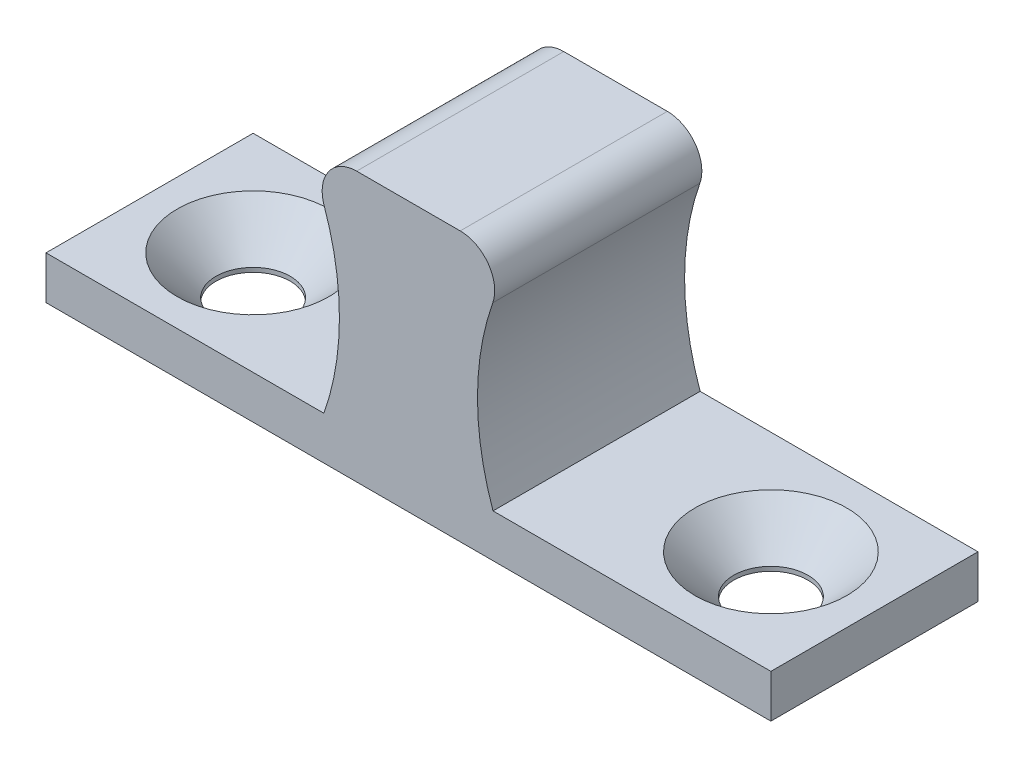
ISO-10303-21;
HEADER;
FILE_DESCRIPTION(('STEP AP214'),'2;1');
FILE_NAME('part.step','',(''),(''),'','','');
FILE_SCHEMA(('AUTOMOTIVE_DESIGN { 1 0 10303 214 1 1 1 1 }'));
ENDSEC;
DATA;
#1=APPLICATION_CONTEXT('core data for automotive mechanical design processes');
#2=APPLICATION_PROTOCOL_DEFINITION('international standard','automotive_design',2000,#1);
#3=PRODUCT_CONTEXT('',#1,'mechanical');
#4=PRODUCT('Part','Part','',(#3));
#5=PRODUCT_RELATED_PRODUCT_CATEGORY('part','',(#4));
#6=PRODUCT_DEFINITION_FORMATION('','',#4);
#7=PRODUCT_DEFINITION_CONTEXT('part definition',#1,'design');
#8=PRODUCT_DEFINITION('design','',#6,#7);
#9=PRODUCT_DEFINITION_SHAPE('','',#8);
#10=(LENGTH_UNIT() NAMED_UNIT(*) SI_UNIT(.MILLI.,.METRE.));
#11=(NAMED_UNIT(*) PLANE_ANGLE_UNIT() SI_UNIT($,.RADIAN.));
#12=(NAMED_UNIT(*) SI_UNIT($,.STERADIAN.) SOLID_ANGLE_UNIT());
#13=UNCERTAINTY_MEASURE_WITH_UNIT(LENGTH_MEASURE(1.E-05),#10,'distance_accuracy_value','');
#14=(GEOMETRIC_REPRESENTATION_CONTEXT(3) GLOBAL_UNCERTAINTY_ASSIGNED_CONTEXT((#13)) GLOBAL_UNIT_ASSIGNED_CONTEXT((#10,
#11,#12)) REPRESENTATION_CONTEXT('',''));
#15=CARTESIAN_POINT('',(0.,0.,0.));
#16=DIRECTION('',(0.,0.,1.));
#17=DIRECTION('',(1.,0.,0.));
#18=AXIS2_PLACEMENT_3D('',#15,#16,#17);
#19=CARTESIAN_POINT('',(19.6870713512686,7.73705341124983,0.));
#20=DIRECTION('',(0.,0.,1.));
#21=DIRECTION('',(1.,0.,0.));
#22=AXIS2_PLACEMENT_3D('',#19,#20,#21);
#23=CYLINDRICAL_SURFACE('',#22,15.6870713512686);
#24=DIRECTION('',(0.,0.,1.));
#25=VECTOR('',#24,1.);
#26=CARTESIAN_POINT('',(4.9,2.5,0.));
#27=LINE('',#26,#25);
#28=CARTESIAN_POINT('',(4.9,2.5,-6.));
#29=VERTEX_POINT('',#28);
#30=CARTESIAN_POINT('',(4.9,2.5,6.));
#31=VERTEX_POINT('',#30);
#32=EDGE_CURVE('E89',#29,#31,#27,.T.);
#33=ORIENTED_EDGE('',*,*,#32,.F.);
#34=CARTESIAN_POINT('',(19.6870713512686,7.73705341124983,-6.));
#35=DIRECTION('',(0.,0.,1.));
#36=DIRECTION('',(1.,0.,0.));
#37=AXIS2_PLACEMENT_3D('',#34,#35,#36);
#38=CIRCLE('',#37,15.6870713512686);
#39=CARTESIAN_POINT('',(4.8869230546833,12.9370359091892,-6.));
#40=VERTEX_POINT('',#39);
#41=EDGE_CURVE('E100',#29,#40,#38,.F.);
#42=ORIENTED_EDGE('',*,*,#41,.T.);
#43=DIRECTION('',(0.,0.,1.));
#44=VECTOR('',#43,1.);
#45=CARTESIAN_POINT('',(4.8869230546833,12.9370359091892,0.));
#46=LINE('',#45,#44);
#47=CARTESIAN_POINT('',(4.8869230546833,12.9370359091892,6.));
#48=VERTEX_POINT('',#47);
#49=EDGE_CURVE('E94',#48,#40,#46,.F.);
#50=ORIENTED_EDGE('',*,*,#49,.F.);
#51=CARTESIAN_POINT('',(19.6870713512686,7.73705341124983,6.));
#52=DIRECTION('',(0.,0.,1.));
#53=DIRECTION('',(1.,0.,0.));
#54=AXIS2_PLACEMENT_3D('',#51,#52,#53);
#55=CIRCLE('',#54,15.6870713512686);
#56=EDGE_CURVE('E97',#31,#48,#55,.F.);
#57=ORIENTED_EDGE('',*,*,#56,.F.);
#58=EDGE_LOOP('',(#33,#42,#50,#57));
#59=FACE_BOUND('',#58,.T.);
#60=ADVANCED_FACE('F15',(#59),#23,.F.);
#61=CARTESIAN_POINT('',(3.,13.6,0.));
#62=DIRECTION('',(0.,0.,1.));
#63=DIRECTION('',(1.,0.,0.));
#64=AXIS2_PLACEMENT_3D('',#61,#62,#63);
#65=CYLINDRICAL_SURFACE('',#64,2.);
#66=CARTESIAN_POINT('',(3.,13.6,-6.));
#67=DIRECTION('',(0.,0.,1.));
#68=DIRECTION('',(1.,0.,0.));
#69=AXIS2_PLACEMENT_3D('',#66,#67,#68);
#70=CIRCLE('',#69,2.);
#71=CARTESIAN_POINT('',(2.99999999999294,15.6,-6.));
#72=VERTEX_POINT('',#71);
#73=EDGE_CURVE('E166',#40,#72,#70,.T.);
#74=ORIENTED_EDGE('',*,*,#73,.T.);
#75=DIRECTION('',(0.,0.,1.));
#76=VECTOR('',#75,1.);
#77=CARTESIAN_POINT('',(2.99999999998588,15.6,0.));
#78=LINE('',#77,#76);
#79=CARTESIAN_POINT('',(2.99999999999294,15.6,6.));
#80=VERTEX_POINT('',#79);
#81=EDGE_CURVE('E103',#80,#72,#78,.F.);
#82=ORIENTED_EDGE('',*,*,#81,.F.);
#83=CARTESIAN_POINT('',(3.,13.6,6.));
#84=DIRECTION('',(0.,0.,1.));
#85=DIRECTION('',(1.,0.,0.));
#86=AXIS2_PLACEMENT_3D('',#83,#84,#85);
#87=CIRCLE('',#86,2.);
#88=EDGE_CURVE('E106',#48,#80,#87,.T.);
#89=ORIENTED_EDGE('',*,*,#88,.F.);
#90=ORIENTED_EDGE('',*,*,#49,.T.);
#91=EDGE_LOOP('',(#74,#82,#89,#90));
#92=FACE_BOUND('',#91,.T.);
#93=ADVANCED_FACE('F107',(#92),#65,.T.);
#94=CARTESIAN_POINT('',(-3.,15.6,0.));
#95=DIRECTION('',(0.,1.,0.));
#96=DIRECTION('',(0.,0.,1.));
#97=AXIS2_PLACEMENT_3D('',#94,#95,#96);
#98=PLANE('',#97);
#99=DIRECTION('',(1.,0.,0.));
#100=VECTOR('',#99,1.);
#101=CARTESIAN_POINT('',(0.,15.6,-6.));
#102=LINE('',#101,#100);
#103=CARTESIAN_POINT('',(-3.,15.6,-6.));
#104=VERTEX_POINT('',#103);
#105=EDGE_CURVE('E165',#72,#104,#102,.F.);
#106=ORIENTED_EDGE('',*,*,#105,.T.);
#107=DIRECTION('',(0.,0.,1.));
#108=VECTOR('',#107,1.);
#109=CARTESIAN_POINT('',(-3.,15.6,0.));
#110=LINE('',#109,#108);
#111=CARTESIAN_POINT('',(-3.,15.6,6.));
#112=VERTEX_POINT('',#111);
#113=EDGE_CURVE('E182',#112,#104,#110,.F.);
#114=ORIENTED_EDGE('',*,*,#113,.F.);
#115=DIRECTION('',(1.,0.,0.));
#116=VECTOR('',#115,1.);
#117=CARTESIAN_POINT('',(0.,15.6,6.));
#118=LINE('',#117,#116);
#119=EDGE_CURVE('E112',#80,#112,#118,.F.);
#120=ORIENTED_EDGE('',*,*,#119,.F.);
#121=ORIENTED_EDGE('',*,*,#81,.T.);
#122=EDGE_LOOP('',(#106,#114,#120,#121));
#123=FACE_BOUND('',#122,.T.);
#124=ADVANCED_FACE('F186',(#123),#98,.T.);
#125=CARTESIAN_POINT('',(-3.,13.6,0.));
#126=DIRECTION('',(0.,0.,1.));
#127=DIRECTION('',(1.,0.,0.));
#128=AXIS2_PLACEMENT_3D('',#125,#126,#127);
#129=CYLINDRICAL_SURFACE('',#128,2.);
#130=CARTESIAN_POINT('',(-3.,13.6,-6.));
#131=DIRECTION('',(0.,0.,1.));
#132=DIRECTION('',(1.,0.,0.));
#133=AXIS2_PLACEMENT_3D('',#130,#131,#132);
#134=CIRCLE('',#133,2.);
#135=CARTESIAN_POINT('',(-4.88692305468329,12.9370359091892,-6.));
#136=VERTEX_POINT('',#135);
#137=EDGE_CURVE('E163',#104,#136,#134,.T.);
#138=ORIENTED_EDGE('',*,*,#137,.T.);
#139=DIRECTION('',(0.,0.,1.));
#140=VECTOR('',#139,1.);
#141=CARTESIAN_POINT('',(-4.88692305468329,12.9370359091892,0.));
#142=LINE('',#141,#140);
#143=CARTESIAN_POINT('',(-4.88692305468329,12.9370359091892,6.));
#144=VERTEX_POINT('',#143);
#145=EDGE_CURVE('E131',#136,#144,#142,.T.);
#146=ORIENTED_EDGE('',*,*,#145,.T.);
#147=CARTESIAN_POINT('',(-3.,13.6,6.));
#148=DIRECTION('',(0.,0.,1.));
#149=DIRECTION('',(1.,0.,0.));
#150=AXIS2_PLACEMENT_3D('',#147,#148,#149);
#151=CIRCLE('',#150,2.);
#152=EDGE_CURVE('E171',#112,#144,#151,.T.);
#153=ORIENTED_EDGE('',*,*,#152,.F.);
#154=ORIENTED_EDGE('',*,*,#113,.T.);
#155=EDGE_LOOP('',(#138,#146,#153,#154));
#156=FACE_BOUND('',#155,.T.);
#157=ADVANCED_FACE('F265',(#156),#129,.T.);
#158=CARTESIAN_POINT('',(-19.6870713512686,7.73705341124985,0.));
#159=DIRECTION('',(0.,0.,1.));
#160=DIRECTION('',(1.,0.,0.));
#161=AXIS2_PLACEMENT_3D('',#158,#159,#160);
#162=CYLINDRICAL_SURFACE('',#161,15.6870713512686);
#163=ORIENTED_EDGE('',*,*,#145,.F.);
#164=CARTESIAN_POINT('',(-19.6870713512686,7.73705341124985,-6.));
#165=DIRECTION('',(0.,0.,1.));
#166=DIRECTION('',(1.,0.,0.));
#167=AXIS2_PLACEMENT_3D('',#164,#165,#166);
#168=CIRCLE('',#167,15.6870713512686);
#169=CARTESIAN_POINT('',(-4.9,2.5,-6.));
#170=VERTEX_POINT('',#169);
#171=EDGE_CURVE('E160',#136,#170,#168,.F.);
#172=ORIENTED_EDGE('',*,*,#171,.T.);
#173=DIRECTION('',(0.,0.,1.));
#174=VECTOR('',#173,1.);
#175=CARTESIAN_POINT('',(-4.9,2.5,0.));
#176=LINE('',#175,#174);
#177=CARTESIAN_POINT('',(-4.9,2.5,6.));
#178=VERTEX_POINT('',#177);
#179=EDGE_CURVE('E128',#178,#170,#176,.F.);
#180=ORIENTED_EDGE('',*,*,#179,.F.);
#181=CARTESIAN_POINT('',(-19.6870713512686,7.73705341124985,6.));
#182=DIRECTION('',(0.,0.,1.));
#183=DIRECTION('',(1.,0.,0.));
#184=AXIS2_PLACEMENT_3D('',#181,#182,#183);
#185=CIRCLE('',#184,15.6870713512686);
#186=EDGE_CURVE('E170',#144,#178,#185,.F.);
#187=ORIENTED_EDGE('',*,*,#186,.F.);
#188=EDGE_LOOP('',(#163,#172,#180,#187));
#189=FACE_BOUND('',#188,.T.);
#190=ADVANCED_FACE('F268',(#189),#162,.F.);
#191=CARTESIAN_POINT('',(-21.,2.5,0.));
#192=DIRECTION('',(0.,1.,0.));
#193=DIRECTION('',(0.,0.,1.));
#194=AXIS2_PLACEMENT_3D('',#191,#192,#193);
#195=PLANE('',#194);
#196=CARTESIAN_POINT('',(-15.,2.5,0.));
#197=DIRECTION('',(0.,1.,0.));
#198=DIRECTION('',(0.,0.,1.));
#199=AXIS2_PLACEMENT_3D('',#196,#197,#198);
#200=CIRCLE('',#199,4.4);
#201=CARTESIAN_POINT('',(-15.,2.5,4.4));
#202=VERTEX_POINT('',#201);
#203=EDGE_CURVE('E19',#202,#202,#200,.F.);
#204=ORIENTED_EDGE('',*,*,#203,.T.);
#205=EDGE_LOOP('',(#204));
#206=FACE_BOUND('',#205,.T.);
#207=DIRECTION('',(1.,0.,0.));
#208=VECTOR('',#207,1.);
#209=CARTESIAN_POINT('',(0.,2.5,-6.));
#210=LINE('',#209,#208);
#211=CARTESIAN_POINT('',(-21.,2.5,-6.));
#212=VERTEX_POINT('',#211);
#213=EDGE_CURVE('E162',#170,#212,#210,.F.);
#214=ORIENTED_EDGE('',*,*,#213,.T.);
#215=DIRECTION('',(0.,0.,1.));
#216=VECTOR('',#215,1.);
#217=CARTESIAN_POINT('',(-21.,2.5,0.));
#218=LINE('',#217,#216);
#219=CARTESIAN_POINT('',(-21.,2.5,6.));
#220=VERTEX_POINT('',#219);
#221=EDGE_CURVE('E144',#220,#212,#218,.F.);
#222=ORIENTED_EDGE('',*,*,#221,.F.);
#223=DIRECTION('',(1.,0.,0.));
#224=VECTOR('',#223,1.);
#225=CARTESIAN_POINT('',(0.,2.5,6.));
#226=LINE('',#225,#224);
#227=EDGE_CURVE('E145',#178,#220,#226,.F.);
#228=ORIENTED_EDGE('',*,*,#227,.F.);
#229=ORIENTED_EDGE('',*,*,#179,.T.);
#230=EDGE_LOOP('',(#214,#222,#228,#229));
#231=FACE_BOUND('',#230,.T.);
#232=ADVANCED_FACE('F256',(#206,#231),#195,.T.);
#233=CARTESIAN_POINT('',(4.9,2.5,0.));
#234=DIRECTION('',(0.,1.,0.));
#235=DIRECTION('',(0.,0.,1.));
#236=AXIS2_PLACEMENT_3D('',#233,#234,#235);
#237=PLANE('',#236);
#238=CARTESIAN_POINT('',(15.,2.5,0.));
#239=DIRECTION('',(0.,1.,0.));
#240=DIRECTION('',(0.,0.,1.));
#241=AXIS2_PLACEMENT_3D('',#238,#239,#240);
#242=CIRCLE('',#241,4.4);
#243=CARTESIAN_POINT('',(15.,2.5,4.4));
#244=VERTEX_POINT('',#243);
#245=EDGE_CURVE('E119',#244,#244,#242,.F.);
#246=ORIENTED_EDGE('',*,*,#245,.T.);
#247=EDGE_LOOP('',(#246));
#248=FACE_BOUND('',#247,.T.);
#249=DIRECTION('',(1.,0.,0.));
#250=VECTOR('',#249,1.);
#251=CARTESIAN_POINT('',(0.,2.5,-6.));
#252=LINE('',#251,#250);
#253=CARTESIAN_POINT('',(21.,2.5,-6.));
#254=VERTEX_POINT('',#253);
#255=EDGE_CURVE('E169',#254,#29,#252,.F.);
#256=ORIENTED_EDGE('',*,*,#255,.T.);
#257=ORIENTED_EDGE('',*,*,#32,.T.);
#258=DIRECTION('',(1.,0.,0.));
#259=VECTOR('',#258,1.);
#260=CARTESIAN_POINT('',(0.,2.5,6.));
#261=LINE('',#260,#259);
#262=CARTESIAN_POINT('',(21.,2.5,6.));
#263=VERTEX_POINT('',#262);
#264=EDGE_CURVE('E117',#263,#31,#261,.F.);
#265=ORIENTED_EDGE('',*,*,#264,.F.);
#266=DIRECTION('',(0.,0.,-1.));
#267=VECTOR('',#266,1.);
#268=CARTESIAN_POINT('',(21.,2.5,0.));
#269=LINE('',#268,#267);
#270=EDGE_CURVE('E135',#254,#263,#269,.F.);
#271=ORIENTED_EDGE('',*,*,#270,.F.);
#272=EDGE_LOOP('',(#256,#257,#265,#271));
#273=FACE_BOUND('',#272,.T.);
#274=ADVANCED_FACE('F195',(#248,#273),#237,.T.);
#275=CARTESIAN_POINT('',(-15.,2.5,0.));
#276=DIRECTION('',(0.,1.,0.));
#277=DIRECTION('',(0.,0.,1.));
#278=AXIS2_PLACEMENT_3D('',#275,#276,#277);
#279=CONICAL_SURFACE('',#278,4.4,0.785398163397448);
#280=ORIENTED_EDGE('',*,*,#203,.F.);
#281=EDGE_LOOP('',(#280));
#282=FACE_BOUND('',#281,.T.);
#283=CARTESIAN_POINT('',(-15.,0.249999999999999,0.));
#284=DIRECTION('',(0.,-1.,0.));
#285=DIRECTION('',(0.,0.,-1.));
#286=AXIS2_PLACEMENT_3D('',#283,#284,#285);
#287=CIRCLE('',#286,2.15);
#288=CARTESIAN_POINT('',(-15.,0.249999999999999,-2.15));
#289=VERTEX_POINT('',#288);
#290=EDGE_CURVE('E138',#289,#289,#287,.T.);
#291=ORIENTED_EDGE('',*,*,#290,.T.);
#292=EDGE_LOOP('',(#291));
#293=FACE_BOUND('',#292,.T.);
#294=ADVANCED_FACE('F214',(#282,#293),#279,.F.);
#295=CARTESIAN_POINT('',(15.,2.5,0.));
#296=DIRECTION('',(0.,1.,0.));
#297=DIRECTION('',(0.,0.,1.));
#298=AXIS2_PLACEMENT_3D('',#295,#296,#297);
#299=CONICAL_SURFACE('',#298,4.4,0.785398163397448);
#300=ORIENTED_EDGE('',*,*,#245,.F.);
#301=EDGE_LOOP('',(#300));
#302=FACE_BOUND('',#301,.T.);
#303=CARTESIAN_POINT('',(15.,0.249999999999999,0.));
#304=DIRECTION('',(0.,-1.,0.));
#305=DIRECTION('',(0.,0.,-1.));
#306=AXIS2_PLACEMENT_3D('',#303,#304,#305);
#307=CIRCLE('',#306,2.15);
#308=CARTESIAN_POINT('',(15.,0.249999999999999,-2.15));
#309=VERTEX_POINT('',#308);
#310=EDGE_CURVE('E153',#309,#309,#307,.T.);
#311=ORIENTED_EDGE('',*,*,#310,.T.);
#312=EDGE_LOOP('',(#311));
#313=FACE_BOUND('',#312,.T.);
#314=ADVANCED_FACE('F17',(#302,#313),#299,.F.);
#315=CARTESIAN_POINT('',(0.,3.99353335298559,6.));
#316=DIRECTION('',(0.,0.,1.));
#317=DIRECTION('',(1.,0.,0.));
#318=AXIS2_PLACEMENT_3D('',#315,#316,#317);
#319=PLANE('',#318);
#320=ORIENTED_EDGE('',*,*,#186,.T.);
#321=ORIENTED_EDGE('',*,*,#227,.T.);
#322=DIRECTION('',(0.,1.,0.));
#323=VECTOR('',#322,1.);
#324=CARTESIAN_POINT('',(-21.,0.,6.));
#325=LINE('',#324,#323);
#326=CARTESIAN_POINT('',(-21.,0.,6.));
#327=VERTEX_POINT('',#326);
#328=EDGE_CURVE('E141',#327,#220,#325,.T.);
#329=ORIENTED_EDGE('',*,*,#328,.F.);
#330=DIRECTION('',(1.,0.,0.));
#331=VECTOR('',#330,1.);
#332=CARTESIAN_POINT('',(0.,0.,6.));
#333=LINE('',#332,#331);
#334=CARTESIAN_POINT('',(21.,0.,6.));
#335=VERTEX_POINT('',#334);
#336=EDGE_CURVE('E150',#335,#327,#333,.F.);
#337=ORIENTED_EDGE('',*,*,#336,.F.);
#338=DIRECTION('',(0.,1.,0.));
#339=VECTOR('',#338,1.);
#340=CARTESIAN_POINT('',(21.,2.5,6.));
#341=LINE('',#340,#339);
#342=EDGE_CURVE('E140',#263,#335,#341,.F.);
#343=ORIENTED_EDGE('',*,*,#342,.F.);
#344=ORIENTED_EDGE('',*,*,#264,.T.);
#345=ORIENTED_EDGE('',*,*,#56,.T.);
#346=ORIENTED_EDGE('',*,*,#88,.T.);
#347=ORIENTED_EDGE('',*,*,#119,.T.);
#348=ORIENTED_EDGE('',*,*,#152,.T.);
#349=EDGE_LOOP('',(#320,#321,#329,#337,#343,#344,#345,#346,#347,#348));
#350=FACE_BOUND('',#349,.T.);
#351=ADVANCED_FACE('F115',(#350),#319,.T.);
#352=CARTESIAN_POINT('',(-21.,0.,0.));
#353=DIRECTION('',(-1.,0.,0.));
#354=DIRECTION('',(0.,0.,1.));
#355=AXIS2_PLACEMENT_3D('',#352,#353,#354);
#356=PLANE('',#355);
#357=DIRECTION('',(0.,1.,0.));
#358=VECTOR('',#357,1.);
#359=CARTESIAN_POINT('',(-21.,3.99353335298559,-6.));
#360=LINE('',#359,#358);
#361=CARTESIAN_POINT('',(-21.,0.,-6.));
#362=VERTEX_POINT('',#361);
#363=EDGE_CURVE('E155',#212,#362,#360,.F.);
#364=ORIENTED_EDGE('',*,*,#363,.T.);
#365=DIRECTION('',(0.,0.,-1.));
#366=VECTOR('',#365,1.);
#367=CARTESIAN_POINT('',(-21.,0.,0.));
#368=LINE('',#367,#366);
#369=EDGE_CURVE('E146',#327,#362,#368,.T.);
#370=ORIENTED_EDGE('',*,*,#369,.F.);
#371=ORIENTED_EDGE('',*,*,#328,.T.);
#372=ORIENTED_EDGE('',*,*,#221,.T.);
#373=EDGE_LOOP('',(#364,#370,#371,#372));
#374=FACE_BOUND('',#373,.T.);
#375=ADVANCED_FACE('F249',(#374),#356,.T.);
#376=CARTESIAN_POINT('',(0.,3.99353335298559,-6.));
#377=DIRECTION('',(0.,0.,1.));
#378=DIRECTION('',(1.,0.,0.));
#379=AXIS2_PLACEMENT_3D('',#376,#377,#378);
#380=PLANE('',#379);
#381=ORIENTED_EDGE('',*,*,#363,.F.);
#382=ORIENTED_EDGE('',*,*,#213,.F.);
#383=ORIENTED_EDGE('',*,*,#171,.F.);
#384=ORIENTED_EDGE('',*,*,#137,.F.);
#385=ORIENTED_EDGE('',*,*,#105,.F.);
#386=ORIENTED_EDGE('',*,*,#73,.F.);
#387=ORIENTED_EDGE('',*,*,#41,.F.);
#388=ORIENTED_EDGE('',*,*,#255,.F.);
#389=DIRECTION('',(0.,1.,0.));
#390=VECTOR('',#389,1.);
#391=CARTESIAN_POINT('',(21.,2.5,-6.));
#392=LINE('',#391,#390);
#393=CARTESIAN_POINT('',(21.,0.,-6.));
#394=VERTEX_POINT('',#393);
#395=EDGE_CURVE('E34',#394,#254,#392,.T.);
#396=ORIENTED_EDGE('',*,*,#395,.F.);
#397=DIRECTION('',(1.,0.,0.));
#398=VECTOR('',#397,1.);
#399=CARTESIAN_POINT('',(0.,0.,-6.));
#400=LINE('',#399,#398);
#401=EDGE_CURVE('E149',#362,#394,#400,.T.);
#402=ORIENTED_EDGE('',*,*,#401,.F.);
#403=EDGE_LOOP('',(#381,#382,#383,#384,#385,#386,#387,#388,#396,#402));
#404=FACE_BOUND('',#403,.T.);
#405=ADVANCED_FACE('F189',(#404),#380,.F.);
#406=CARTESIAN_POINT('',(21.,2.5,0.));
#407=DIRECTION('',(1.,0.,0.));
#408=DIRECTION('',(0.,0.,-1.));
#409=AXIS2_PLACEMENT_3D('',#406,#407,#408);
#410=PLANE('',#409);
#411=ORIENTED_EDGE('',*,*,#395,.T.);
#412=ORIENTED_EDGE('',*,*,#270,.T.);
#413=ORIENTED_EDGE('',*,*,#342,.T.);
#414=DIRECTION('',(0.,0.,-1.));
#415=VECTOR('',#414,1.);
#416=CARTESIAN_POINT('',(21.,0.,0.));
#417=LINE('',#416,#415);
#418=EDGE_CURVE('E159',#394,#335,#417,.F.);
#419=ORIENTED_EDGE('',*,*,#418,.F.);
#420=EDGE_LOOP('',(#411,#412,#413,#419));
#421=FACE_BOUND('',#420,.T.);
#422=ADVANCED_FACE('F197',(#421),#410,.T.);
#423=CARTESIAN_POINT('',(-15.,2.5,0.));
#424=DIRECTION('',(0.,-1.,0.));
#425=DIRECTION('',(0.,0.,-1.));
#426=AXIS2_PLACEMENT_3D('',#423,#424,#425);
#427=CYLINDRICAL_SURFACE('',#426,2.15);
#428=CARTESIAN_POINT('',(-15.,0.,0.));
#429=DIRECTION('',(0.,-1.,0.));
#430=DIRECTION('',(0.,0.,-1.));
#431=AXIS2_PLACEMENT_3D('',#428,#429,#430);
#432=CIRCLE('',#431,2.15);
#433=CARTESIAN_POINT('',(-15.,0.,-2.15));
#434=VERTEX_POINT('',#433);
#435=EDGE_CURVE('E25',#434,#434,#432,.F.);
#436=ORIENTED_EDGE('',*,*,#435,.F.);
#437=EDGE_LOOP('',(#436));
#438=FACE_BOUND('',#437,.T.);
#439=ORIENTED_EDGE('',*,*,#290,.F.);
#440=EDGE_LOOP('',(#439));
#441=FACE_BOUND('',#440,.T.);
#442=ADVANCED_FACE('F216',(#438,#441),#427,.F.);
#443=CARTESIAN_POINT('',(15.,2.5,0.));
#444=DIRECTION('',(0.,-1.,0.));
#445=DIRECTION('',(0.,0.,-1.));
#446=AXIS2_PLACEMENT_3D('',#443,#444,#445);
#447=CYLINDRICAL_SURFACE('',#446,2.15);
#448=CARTESIAN_POINT('',(15.,0.,0.));
#449=DIRECTION('',(0.,-1.,0.));
#450=DIRECTION('',(0.,0.,-1.));
#451=AXIS2_PLACEMENT_3D('',#448,#449,#450);
#452=CIRCLE('',#451,2.15);
#453=CARTESIAN_POINT('',(15.,0.,-2.15));
#454=VERTEX_POINT('',#453);
#455=EDGE_CURVE('E10',#454,#454,#452,.F.);
#456=ORIENTED_EDGE('',*,*,#455,.F.);
#457=EDGE_LOOP('',(#456));
#458=FACE_BOUND('',#457,.T.);
#459=ORIENTED_EDGE('',*,*,#310,.F.);
#460=EDGE_LOOP('',(#459));
#461=FACE_BOUND('',#460,.T.);
#462=ADVANCED_FACE('F218',(#458,#461),#447,.F.);
#463=CARTESIAN_POINT('',(0.,0.,0.));
#464=DIRECTION('',(0.,-1.,0.));
#465=DIRECTION('',(0.,0.,-1.));
#466=AXIS2_PLACEMENT_3D('',#463,#464,#465);
#467=PLANE('',#466);
#468=ORIENTED_EDGE('',*,*,#455,.T.);
#469=EDGE_LOOP('',(#468));
#470=FACE_BOUND('',#469,.T.);
#471=ORIENTED_EDGE('',*,*,#435,.T.);
#472=EDGE_LOOP('',(#471));
#473=FACE_BOUND('',#472,.T.);
#474=ORIENTED_EDGE('',*,*,#401,.T.);
#475=ORIENTED_EDGE('',*,*,#418,.T.);
#476=ORIENTED_EDGE('',*,*,#336,.T.);
#477=ORIENTED_EDGE('',*,*,#369,.T.);
#478=EDGE_LOOP('',(#474,#475,#476,#477));
#479=FACE_BOUND('',#478,.T.);
#480=ADVANCED_FACE('F202',(#470,#473,#479),#467,.T.);
#481=CLOSED_SHELL('',(#60,#93,#124,#157,#190,#232,#274,#294,#314,#351,#375,#405,#422,#442,#462,#480));
#482=MANIFOLD_SOLID_BREP('B1',#481);
#483=ADVANCED_BREP_SHAPE_REPRESENTATION('',(#18,#482),#14);
#484=SHAPE_DEFINITION_REPRESENTATION(#9,#483);
ENDSEC;
END-ISO-10303-21;
